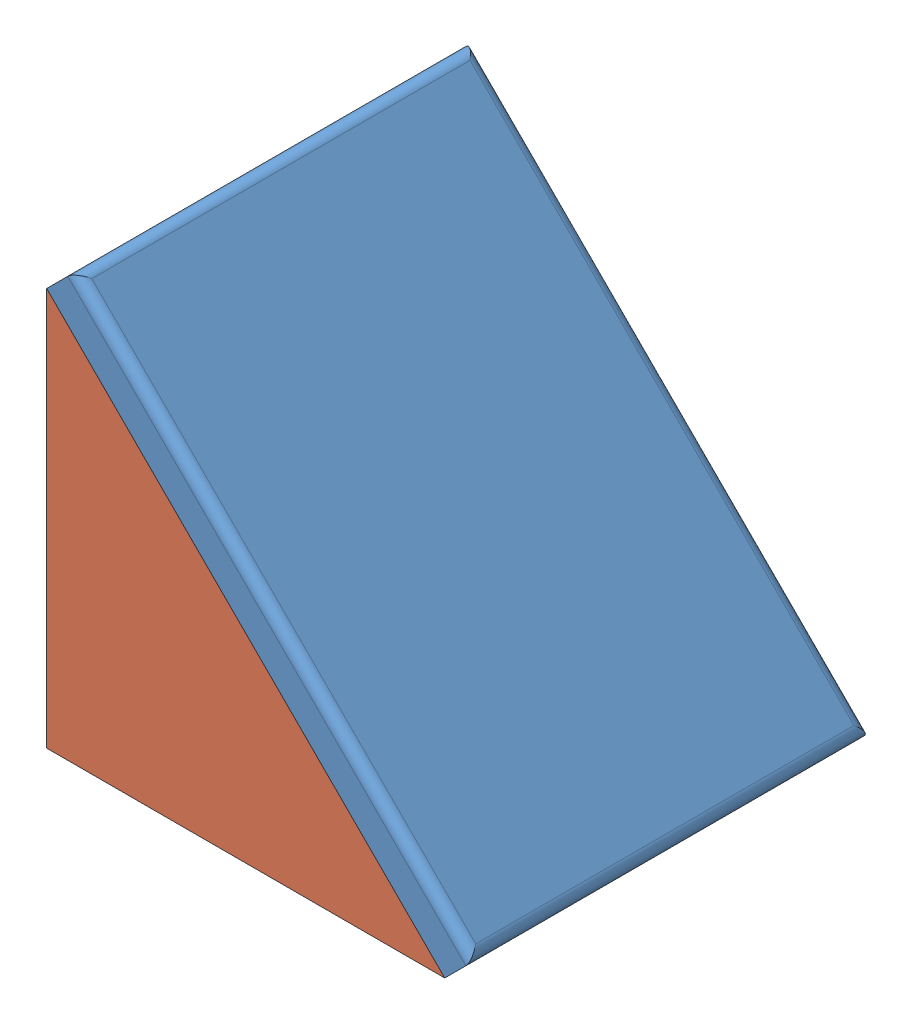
SolidWorks assembly X-Angulo con tapa y tornillos (0.0.411.15).SLDASM, configuration Predeterminado (file format 3800). Lengths in mm.
Overall size (54.83 54.83 40).
4 component instances, 3 part files, 0 mates.
Components (placement in the parent):
- X-Tapa Angulo triangular-1: X-Tapa Angulo triangular.SLDPRT [Predeterminado] at (40 0 40) x (0 0 -1) z (0.707107 0.707107 0) size (40 56.57 4)
- X-Angulo 40x40 Triangular-2: X-Angulo 40x40 Triangular.SLDPRT [Predeterminado] at origin size (43 43 40)
- X-Tornillo M8 x16-2: X-Tornillo M8 x16.SLDPRT [Predeterminado] at (9 20 20) x (0 0 -1) z (-1 0 0) size (14 14 21)
- X-Tornillo M8 x16-1: X-Tornillo M8 x16.SLDPRT [Predeterminado] at (20 9 20) x (1 0 0) z (0 -1 0) size (14 14 21)
